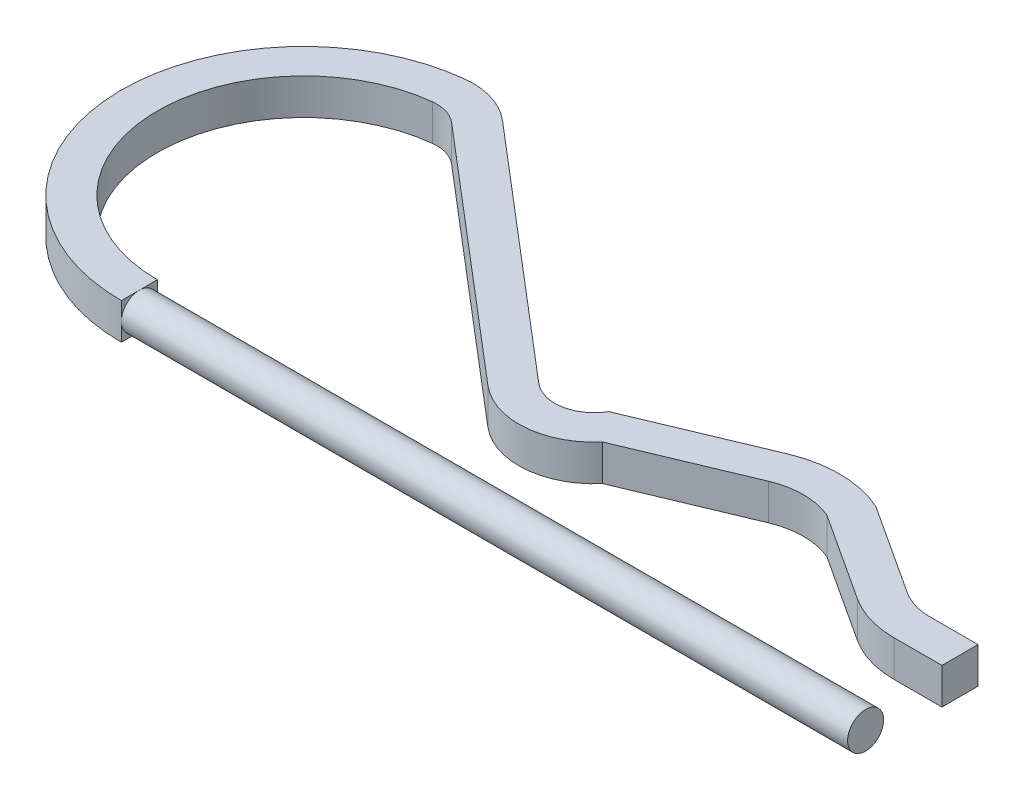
from build123d import *

# Parameters (mm, degrees)
EXTRUDE1_DEPTH = 2.54
SKETCH3_R      = 1.27
EXTRUDE2_DEPTH = 51.143678


with BuildPart() as part:
    # Sketch1 → Extrude1 (new body)
    with BuildSketch(Plane(origin=(0, 0, 0), x_dir=(1, 0, 0), z_dir=(0, 1, 0))):
        with BuildLine():
            Line((-51.143678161, -2.54), (-51.143678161, 0))
            ThreePointArc((-51.143678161, 0), (-61.430018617, 9.719709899), (-52.308102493, 20.539700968))
            ThreePointArc((-52.308102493, 20.539700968), (-51.279323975, 20.445269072), (-50.373248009, 19.94895368))
            Line((-50.373248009, 19.94895368), (-33.058087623, 5.188489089))
            ThreePointArc((-33.058087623, 5.188489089), (-29.191475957, 3.936161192), (-25.57183908, 5.784738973))
            Line((-25.57183908, 5.784738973), (-17.344377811, 9.229738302))
            ThreePointArc((-17.344377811, 9.229738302), (-15.287733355, 9.642936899), (-13.2310889, 9.229738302))
            Line((-13.2310889, 9.229738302), (-7.036104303, 5.188489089))
            ThreePointArc((-7.036104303, 5.188489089), (-5.292809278, 4.381548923), (-3.391834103, 4.104920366))
            Line((-3.391834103, 4.104920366), (0, 4.104920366))
            Line((0, 4.104920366), (0, 6.644920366))
            Line((0, 6.644920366), (-3.391834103, 6.644920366))
            ThreePointArc((-3.391834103, 6.644920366), (-4.568900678, 6.816206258), (-5.648333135, 7.315856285))
            Line((-5.648333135, 7.315856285), (-12.017945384, 11.471022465))
            ThreePointArc((-12.017945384, 11.471022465), (-15.161036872, 12.181916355), (-18.325397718, 11.57264247))
            Line((-18.325397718, 11.57264247), (-27.209144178, 7.852843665))
            ThreePointArc((-27.209144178, 7.852843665), (-29.137948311, 6.500447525), (-31.410302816, 7.12146742))
            Line((-31.410302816, 7.12146742), (-48.725463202, 21.881932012))
            ThreePointArc((-48.725463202, 21.881932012), (-50.537615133, 22.874562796), (-52.59517217, 23.063426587))
            ThreePointArc((-52.59517217, 23.063426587), (-63.965946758, 9.575944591), (-51.143678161, -2.54))
        make_face()
    extrude(amount=EXTRUDE1_DEPTH)

    # Sketch3 → Extrude2 (add, through all)
    with BuildSketch(Plane(origin=(-51.143678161, 0, 0), x_dir=(0, 0, -1), z_dir=(1, 0, 0))):
        with Locations((-1.27, 1.27)):
            Circle(SKETCH3_R)
    extrude(amount=EXTRUDE2_DEPTH)


solid = part.part
